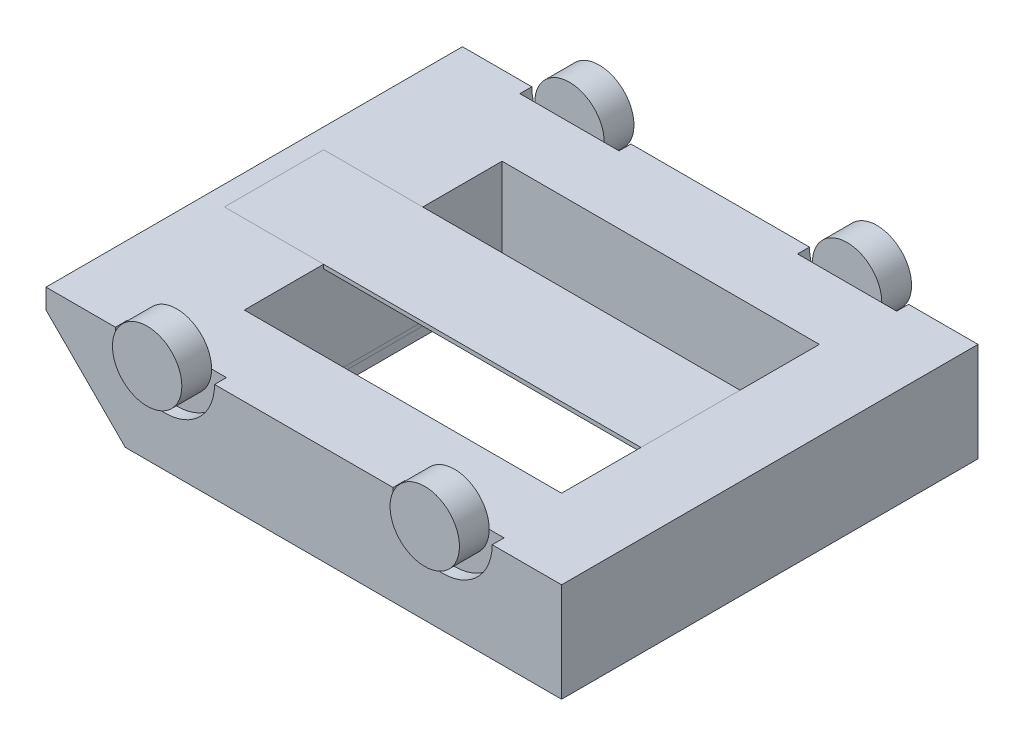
from build123d import *

# Parameters (mm, degrees)
MEMBER_10_1_DEPTH      = 1411.923396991
MEMBER_10_1_DEPTH_BACK = 111.923396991
MEMBER_10_1_2_DEPTH    = 1823.846793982
MEMBER_10_1_3_DEPTH    = 1523.846793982
MEMBER_10_1_4_DEPTH    = 1823.846793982
MEMBER_10_1_5_DEPTH    = 1302
MEMBER_10_1_6_DEPTH    = 1302
SKETCH_4_W             = 64.398136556
SKETCH_4_H             = 20
EXTRUDE_1_DEPTH        = 90
SKETCH_5_R             = 10
CUT_EXTRUDE_1_DEPTH    = 1701.78866706
FILLET_1_R             = 25
FILLET_2_R             = 25
FILLET_3_R             = 25
SKETCH_7_W             = 1800
SKETCH_7_H             = 1500
EXTRUDE_3_DEPTH        = 20
SKETCH_8_W             = 2600
SKETCH_8_H             = 2100
EXTRUDE_4_DEPTH        = 500
CUT_EXTRUDE_2_DEPTH    = 2577.897359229
SKETCH_10_W            = 1600
SKETCH_10_H            = 1300
CUT_EXTRUDE_3_DEPTH    = 1826.623181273
SKETCH_11_W            = 500
SKETCH_11_H            = 20
EXTRUDE_6_DEPTH        = 2500
SKETCH_12_W            = 1200
SKETCH_12_H            = 500
CUT_EXTRUDE_4_DEPTH    = 40
SKETCH_13_R            = 250
CUT_EXTRUDE_5_DEPTH    = 60
SKETCH_14_R            = 250
CUT_EXTRUDE_6_DEPTH    = 60
SKETCH_15_R            = 175
EXTRUDE_7_DEPTH        = 150
EXTRUDE_7_2_DEPTH      = 150
SKETCH_16_R            = 175
EXTRUDE_8_DEPTH        = 150
EXTRUDE_8_2_DEPTH      = 150


with BuildPart() as part:
    # Sketch11 → Member 10_1 (new, two sides: drawn at the far end of the back side and taken through both)
    with BuildSketch(Plane(origin=(-800, 0, 650), x_dir=(0, 1, 0), z_dir=(0, 0, -1)).offset(-MEMBER_10_1_DEPTH_BACK)):
        with BuildLine():
            Line((0, 0), (0, -100))
            Line((0, -100), (-48, -100))
            Line((-48, -100), (-48, -97.265512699))
            ThreePointArc((-48, -97.265512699), (-46.867155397, -94.376595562), (-44.072544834, -93.027769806))
            Line((-44.072544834, -93.027769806), (-13.154910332, -90.674554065))
            ThreePointArc((-13.154910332, -90.674554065), (-7.565689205, -87.976902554), (-5.3, -82.199068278))
            Line((-5.3, -82.199068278), (-5.3, -17.800931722))
            ThreePointArc((-5.3, -17.800931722), (-7.565689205, -12.023097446), (-13.154910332, -9.325445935))
            Line((-13.154910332, -9.325445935), (-44.072544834, -6.972230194))
            ThreePointArc((-44.072544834, -6.972230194), (-46.867155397, -5.623404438), (-48, -2.734487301))
            Line((-48, -2.734487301), (-48, 0))
            Line((-48, 0), (0, 0))
        make_face()
    extrude(amount=MEMBER_10_1_DEPTH + MEMBER_10_1_DEPTH_BACK)

    # Member 10_1 mitre 1
    split(bisect_by=Plane(origin=(-800, 0, 650), x_dir=(0, -1, 0), z_dir=(-0.707106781, 0, -0.707106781)), keep=Keep.TOP)

    # Member 10_1 mitre 2
    split(bisect_by=Plane(origin=(-800, 0, -650), x_dir=(0, -1, 0), z_dir=(-0.707106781, 0, 0.707106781)), keep=Keep.TOP)


with BuildPart() as body_2:
    # Sketch11 on segment 2 (on carried to segment 2) → Member 10_1 2 (new body)
    with BuildSketch(Plane(origin=(-911.923396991, 0, -650), x_dir=(0, 1, 0), z_dir=(1, 0, 0))):
        with BuildLine():
            Line((0, 0), (0, -100))
            Line((0, -100), (-48, -100))
            Line((-48, -100), (-48, -97.265512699))
            ThreePointArc((-48, -97.265512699), (-46.867155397, -94.376595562), (-44.072544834, -93.027769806))
            Line((-44.072544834, -93.027769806), (-13.154910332, -90.674554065))
            ThreePointArc((-13.154910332, -90.674554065), (-7.565689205, -87.976902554), (-5.3, -82.199068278))
            Line((-5.3, -82.199068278), (-5.3, -17.800931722))
            ThreePointArc((-5.3, -17.800931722), (-7.565689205, -12.023097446), (-13.154910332, -9.325445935))
            Line((-13.154910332, -9.325445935), (-44.072544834, -6.972230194))
            ThreePointArc((-44.072544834, -6.972230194), (-46.867155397, -5.623404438), (-48, -2.734487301))
            Line((-48, -2.734487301), (-48, 0))
            Line((-48, 0), (0, 0))
        make_face()
    extrude(amount=MEMBER_10_1_2_DEPTH)

    # Member 10_1 2 mitre 1
    split(bisect_by=Plane(origin=(-800, 0, -650), x_dir=(0, 1, 0), z_dir=(0.707106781, 0, -0.707106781)), keep=Keep.TOP)

    # Member 10_1 2 mitre 2
    split(bisect_by=Plane(origin=(800, 0, -650), x_dir=(0, -1, 0), z_dir=(-0.707106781, 0, -0.707106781)), keep=Keep.TOP)


with BuildPart() as body_3:
    # Sketch11 on segment 3 (on carried to segment 3) → Member 10_1 3 (new body)
    with BuildSketch(Plane(origin=(800, 0, -761.923396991), x_dir=(0, 1, 0), z_dir=(0, 0, 1))):
        with BuildLine():
            Line((0, 0), (0, -100))
            Line((0, -100), (-48, -100))
            Line((-48, -100), (-48, -97.265512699))
            ThreePointArc((-48, -97.265512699), (-46.867155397, -94.376595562), (-44.072544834, -93.027769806))
            Line((-44.072544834, -93.027769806), (-13.154910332, -90.674554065))
            ThreePointArc((-13.154910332, -90.674554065), (-7.565689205, -87.976902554), (-5.3, -82.199068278))
            Line((-5.3, -82.199068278), (-5.3, -17.800931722))
            ThreePointArc((-5.3, -17.800931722), (-7.565689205, -12.023097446), (-13.154910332, -9.325445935))
            Line((-13.154910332, -9.325445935), (-44.072544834, -6.972230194))
            ThreePointArc((-44.072544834, -6.972230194), (-46.867155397, -5.623404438), (-48, -2.734487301))
            Line((-48, -2.734487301), (-48, 0))
            Line((-48, 0), (0, 0))
        make_face()
    extrude(amount=MEMBER_10_1_3_DEPTH)

    # Member 10_1 3 mitre 1
    split(bisect_by=Plane(origin=(800, 0, 650), x_dir=(0, 1, 0), z_dir=(0.707106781, 0, -0.707106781)), keep=Keep.TOP)

    # Member 10_1 3 mitre 2
    split(bisect_by=Plane(origin=(800, 0, -650), x_dir=(0, 1, 0), z_dir=(0.707106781, 0, 0.707106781)), keep=Keep.TOP)

    # Sketch 4 → Extrude 1 (add)
    with BuildSketch(Plane.XZ.offset(5.3)):
        with Locations((850, -680)):
            Rectangle(SKETCH_4_W, SKETCH_4_H)
        with Locations((850, 680)):
            Rectangle(SKETCH_4_W, SKETCH_4_H)
        with Locations((-850, 430)):
            Rectangle(SKETCH_4_W, SKETCH_4_H)
        with Locations((-850, -430)):
            Rectangle(SKETCH_4_W, SKETCH_4_H)
    extrude(amount=EXTRUDE_1_DEPTH)


with BuildPart() as body_4:
    # Sketch11 on segment 4 (on carried to segment 4) → Member 10_1 4 (new body)
    with BuildSketch(Plane(origin=(911.923396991, 0, 650), x_dir=(0, 1, 0), z_dir=(-1, 0, 0))):
        with BuildLine():
            Line((0, 0), (0, -100))
            Line((0, -100), (-48, -100))
            Line((-48, -100), (-48, -97.265512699))
            ThreePointArc((-48, -97.265512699), (-46.867155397, -94.376595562), (-44.072544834, -93.027769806))
            Line((-44.072544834, -93.027769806), (-13.154910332, -90.674554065))
            ThreePointArc((-13.154910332, -90.674554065), (-7.565689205, -87.976902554), (-5.3, -82.199068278))
            Line((-5.3, -82.199068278), (-5.3, -17.800931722))
            ThreePointArc((-5.3, -17.800931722), (-7.565689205, -12.023097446), (-13.154910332, -9.325445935))
            Line((-13.154910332, -9.325445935), (-44.072544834, -6.972230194))
            ThreePointArc((-44.072544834, -6.972230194), (-46.867155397, -5.623404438), (-48, -2.734487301))
            Line((-48, -2.734487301), (-48, 0))
            Line((-48, 0), (0, 0))
        make_face()
    extrude(amount=MEMBER_10_1_4_DEPTH)

    # Member 10_1 4 mitre 1
    split(bisect_by=Plane(origin=(-800, 0, 650), x_dir=(0, 1, 0), z_dir=(0.707106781, 0, 0.707106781)), keep=Keep.TOP)

    # Member 10_1 4 mitre 2
    split(bisect_by=Plane(origin=(800, 0, 650), x_dir=(0, -1, 0), z_dir=(-0.707106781, 0, 0.707106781)), keep=Keep.TOP)


with BuildPart() as body_5:
    # Sketch11 on segment 5 (on carried to segment 5) → Member 10_1 5 (new body)
    with BuildSketch(Plane(origin=(-400, 0, -651), x_dir=(0, 1, 0), z_dir=(0, 0, 1))):
        with BuildLine():
            Line((0, 0), (0, -100))
            Line((0, -100), (-48, -100))
            Line((-48, -100), (-48, -97.265512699))
            ThreePointArc((-48, -97.265512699), (-46.867155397, -94.376595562), (-44.072544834, -93.027769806))
            Line((-44.072544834, -93.027769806), (-13.154910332, -90.674554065))
            ThreePointArc((-13.154910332, -90.674554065), (-7.565689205, -87.976902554), (-5.3, -82.199068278))
            Line((-5.3, -82.199068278), (-5.3, -17.800931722))
            ThreePointArc((-5.3, -17.800931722), (-7.565689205, -12.023097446), (-13.154910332, -9.325445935))
            Line((-13.154910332, -9.325445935), (-44.072544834, -6.972230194))
            ThreePointArc((-44.072544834, -6.972230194), (-46.867155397, -5.623404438), (-48, -2.734487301))
            Line((-48, -2.734487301), (-48, 0))
            Line((-48, 0), (0, 0))
        make_face()
    extrude(amount=MEMBER_10_1_5_DEPTH)

    # Member 10_1 5 mitre 1
    split(bisect_by=Plane(origin=(-400, 0, -650), x_dir=(0, -1, 0), z_dir=(0, 0, 1)), keep=Keep.TOP)

    # Member 10_1 5 mitre 2
    split(bisect_by=Plane(origin=(-400, 0, 650), x_dir=(0, 1, 0), z_dir=(0, 0, -1)), keep=Keep.TOP)


with BuildPart() as body_6:
    # Sketch11 on segment 6 (on carried to segment 6) → Member 10_1 6 (new body)
    with BuildSketch(Plane(origin=(300, 0, -651), x_dir=(0, 1, 0), z_dir=(0, 0, 1))):
        with BuildLine():
            Line((0, 0), (0, -100))
            Line((0, -100), (-48, -100))
            Line((-48, -100), (-48, -97.265512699))
            ThreePointArc((-48, -97.265512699), (-46.867155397, -94.376595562), (-44.072544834, -93.027769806))
            Line((-44.072544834, -93.027769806), (-13.154910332, -90.674554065))
            ThreePointArc((-13.154910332, -90.674554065), (-7.565689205, -87.976902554), (-5.3, -82.199068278))
            Line((-5.3, -82.199068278), (-5.3, -17.800931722))
            ThreePointArc((-5.3, -17.800931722), (-7.565689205, -12.023097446), (-13.154910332, -9.325445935))
            Line((-13.154910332, -9.325445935), (-44.072544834, -6.972230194))
            ThreePointArc((-44.072544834, -6.972230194), (-46.867155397, -5.623404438), (-48, -2.734487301))
            Line((-48, -2.734487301), (-48, 0))
            Line((-48, 0), (0, 0))
        make_face()
    extrude(amount=MEMBER_10_1_6_DEPTH)

    # Member 10_1 6 mitre 1
    split(bisect_by=Plane(origin=(300, 0, -650), x_dir=(0, -1, 0), z_dir=(0, 0, 1)), keep=Keep.TOP)

    # Member 10_1 6 mitre 2
    split(bisect_by=Plane(origin=(300, 0, 650), x_dir=(0, 1, 0), z_dir=(0, 0, -1)), keep=Keep.TOP)


with BuildPart() as extrude_1_piece_1:
    # of the separate pieces the step leaves, piece 1, a body of its own (extrude_1_pieces)
    add(body_3.part.solids().sort_by_distance((809.325445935, -13.154910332, -659.325445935))[0])


with BuildPart() as extrude_1_piece_2:
    # of the separate pieces the step leaves, piece 2, a body of its own (extrude_1_pieces)
    add(body_3.part.solids().sort_by_distance((-882.199068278, -5.3, 440))[0])


with BuildPart() as extrude_1_piece_3:
    # of the separate pieces the step leaves, piece 3, a body of its own (extrude_1_pieces)
    add(body_3.part.solids().sort_by_distance((-817.800931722, -5.3, -440))[0])


with BuildPart() as cut_extrude_1_tool:
    # Sketch 5 → Cut-Extrude 1 (new, through all)
    with BuildSketch(Plane(origin=(0, 0, -690), x_dir=(-1, 0, 0), z_dir=(0, 0, -1))):
        with Locations((-850, -75.3)):
            Circle(SKETCH_5_R)
        with Locations((850, -75.3)):
            Circle(SKETCH_5_R)
    extrude(amount=-CUT_EXTRUDE_1_DEPTH)


with BuildPart() as extrude_1_piece_1_1:
    add(extrude_1_piece_1.part)

    # Cut-Extrude 1: cut by cut_extrude_1_tool
    add(cut_extrude_1_tool.part, mode=Mode.SUBTRACT)

    # Fillet 1
    fillet_1_edges = [extrude_1_piece_1_1.edges().sort_by_distance(p)[0] for p in [
        (817.800931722, -95.3, -680),
        (882.199068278, -95.3, -680),
        (882.199068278, -95.3, 680),
        (817.800931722, -95.3, 680),
    ]]
    fillet(fillet_1_edges, radius=FILLET_1_R)


with BuildPart() as extrude_1_piece_2_1:
    add(extrude_1_piece_2.part)

    # Cut-Extrude 1: cut by cut_extrude_1_tool
    add(cut_extrude_1_tool.part, mode=Mode.SUBTRACT)

    # Fillet 2
    fillet_2_edges = [extrude_1_piece_2_1.edges().sort_by_distance(p)[0] for p in [
        (-817.800931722, -95.3, 430),
        (-882.199068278, -95.3, 430),
    ]]
    fillet(fillet_2_edges, radius=FILLET_2_R)


with BuildPart() as extrude_1_piece_3_1:
    add(extrude_1_piece_3.part)

    # Cut-Extrude 1: cut by cut_extrude_1_tool
    add(cut_extrude_1_tool.part, mode=Mode.SUBTRACT)

    # Fillet 3
    fillet_3_edges = [extrude_1_piece_3_1.edges().sort_by_distance(p)[0] for p in [
        (-882.199068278, -95.3, -430),
        (-817.800931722, -95.3, -430),
    ]]
    fillet(fillet_3_edges, radius=FILLET_3_R)


with BuildPart() as body_9:
    # Sketch 7 → Extrude 3 (new body)
    with BuildSketch(Plane(origin=(0, 0, 0), x_dir=(1, 0, 0), z_dir=(0, 1, 0))):
        Rectangle(SKETCH_7_W, SKETCH_7_H)
    extrude(amount=EXTRUDE_3_DEPTH)


with BuildPart() as body_8:
    # Sketch 8 → Extrude 4 (new body)
    with BuildSketch(Plane(origin=(0, 20, 0), x_dir=(1, 0, 0), z_dir=(0, 1, 0))):
        with Locations((-100, 0)):
            Rectangle(SKETCH_8_W, SKETCH_8_H)
    extrude(amount=EXTRUDE_4_DEPTH)

    # Sketch 9 → Cut-Extrude 2 (cut, through all)
    with BuildSketch(Plane(origin=(0, 0, -1050), x_dir=(-1, 0, 0), z_dir=(0, 0, -1))):
        Polygon((1400, 20), (1400, 420), (1000, 20), align=None)
    extrude(amount=-CUT_EXTRUDE_2_DEPTH, mode=Mode.SUBTRACT)


with BuildPart() as cut_extrude_3_tool:
    # Sketch 10 → Cut-Extrude 3 (new, through all)
    with BuildSketch(Plane(origin=(0, 0, 0), x_dir=(-1, 0, 0), z_dir=(0, -1, 0))):
        Rectangle(SKETCH_10_W, SKETCH_10_H)
    extrude(amount=-CUT_EXTRUDE_3_DEPTH)


with BuildPart() as body_9_1:
    add(body_9.part)

    # Cut-Extrude 3: cut by cut_extrude_3_tool
    add(cut_extrude_3_tool.part, mode=Mode.SUBTRACT)


with BuildPart() as body_8_1:
    add(body_8.part)

    # Cut-Extrude 3: cut by cut_extrude_3_tool
    add(cut_extrude_3_tool.part, mode=Mode.SUBTRACT)

    # Sketch 12 → Cut-Extrude 4 (cut)
    with BuildSketch(Plane(origin=(-490, -490, 0), x_dir=(0, 0, 1), z_dir=(-0.7071067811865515, -0.7071067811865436, -2.2876856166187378e-15))):
        with Locations((0, 1036.93434176)):
            Rectangle(SKETCH_12_W, SKETCH_12_H)
    extrude(amount=-CUT_EXTRUDE_4_DEPTH, mode=Mode.SUBTRACT)

    # Sketch 13 → Cut-Extrude 5 (cut)
    with BuildSketch(Plane(origin=(0, 0, -1050), x_dir=(-1, 0, 0), z_dir=(0, 0, -1))):
        with Locations((800, 520)):
            Circle(SKETCH_13_R)
        with Locations((-600, 520)):
            Circle(SKETCH_13_R)
    extrude(amount=-CUT_EXTRUDE_5_DEPTH, mode=Mode.SUBTRACT)

    # Sketch 14 → Cut-Extrude 6 (cut)
    with BuildSketch(Plane.XY.offset(1050)):
        with Locations((600, 520)):
            Circle(SKETCH_14_R)
        with Locations((-800, 520)):
            Circle(SKETCH_14_R)
    extrude(amount=-CUT_EXTRUDE_6_DEPTH, mode=Mode.SUBTRACT)


with BuildPart() as body_9_2:
    # Sketch 11 → Extrude 6 (new body)
    with BuildSketch(Plane(origin=(1200, 0, 0), x_dir=(0, 0, -1), z_dir=(1, 0, 0))):
        with Locations((0, 510)):
            Rectangle(SKETCH_11_W, SKETCH_11_H)
    extrude(amount=-EXTRUDE_6_DEPTH)


with BuildPart() as body_10:
    # Sketch 15 → Extrude 7 (new body)
    with BuildSketch(Plane.XY.offset(990)):
        with Locations((600, 520)):
            Circle(SKETCH_15_R)
    extrude(amount=EXTRUDE_7_DEPTH)


with BuildPart() as body_11:
    # Sketch 15 → Extrude 7 2 (new body)
    with BuildSketch(Plane.XY.offset(990)):
        with Locations((-800, 520)):
            Circle(SKETCH_15_R)
    extrude(amount=EXTRUDE_7_2_DEPTH)


with BuildPart() as body_12:
    # Sketch 16 → Extrude 8 (new body)
    with BuildSketch(Plane(origin=(0, 0, -990), x_dir=(-1, 0, 0), z_dir=(0, 0, -1))):
        with Locations(Location((800, 520, 0), (0, 0, 90))):
            Circle(SKETCH_16_R)
    extrude(amount=EXTRUDE_8_DEPTH)


with BuildPart() as body_13:
    # Sketch 16 → Extrude 8 2 (new body)
    with BuildSketch(Plane(origin=(0, 0, -990), x_dir=(-1, 0, 0), z_dir=(0, 0, -1))):
        with Locations(Location((-600, 520, 0), (0, 0, 90))):
            Circle(SKETCH_16_R)
    extrude(amount=EXTRUDE_8_2_DEPTH)


solid = Compound([part.part, body_2.part, body_4.part, extrude_1_piece_1_1.part, extrude_1_piece_2_1.part, extrude_1_piece_3_1.part, body_9_1.part, body_8_1.part, body_9_2.part, body_10.part, body_11.part, body_12.part, body_13.part])
